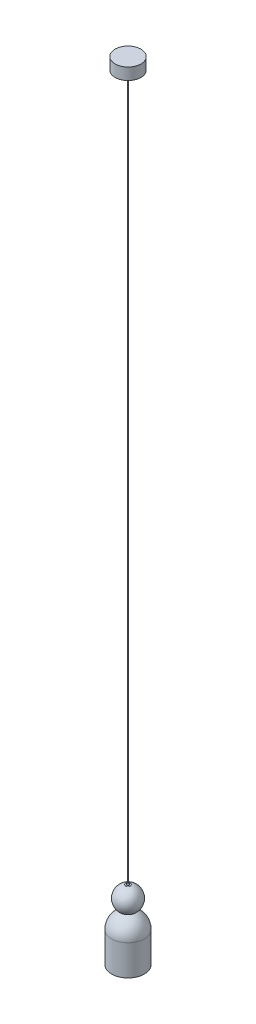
ISO-10303-21;
HEADER;
FILE_DESCRIPTION(('STEP AP214'),'2;1');
FILE_NAME('part.step','',(''),(''),'','','');
FILE_SCHEMA(('AUTOMOTIVE_DESIGN { 1 0 10303 214 1 1 1 1 }'));
ENDSEC;
DATA;
#1=APPLICATION_CONTEXT('core data for automotive mechanical design processes');
#2=APPLICATION_PROTOCOL_DEFINITION('international standard','automotive_design',2000,#1);
#3=PRODUCT_CONTEXT('',#1,'mechanical');
#4=PRODUCT('Part','Part','',(#3));
#5=PRODUCT_RELATED_PRODUCT_CATEGORY('part','',(#4));
#6=PRODUCT_DEFINITION_FORMATION('','',#4);
#7=PRODUCT_DEFINITION_CONTEXT('part definition',#1,'design');
#8=PRODUCT_DEFINITION('design','',#6,#7);
#9=PRODUCT_DEFINITION_SHAPE('','',#8);
#10=(LENGTH_UNIT() NAMED_UNIT(*) SI_UNIT(.MILLI.,.METRE.));
#11=(NAMED_UNIT(*) PLANE_ANGLE_UNIT() SI_UNIT($,.RADIAN.));
#12=(NAMED_UNIT(*) SI_UNIT($,.STERADIAN.) SOLID_ANGLE_UNIT());
#13=UNCERTAINTY_MEASURE_WITH_UNIT(LENGTH_MEASURE(1.E-05),#10,'distance_accuracy_value','');
#14=(GEOMETRIC_REPRESENTATION_CONTEXT(3) GLOBAL_UNCERTAINTY_ASSIGNED_CONTEXT((#13)) GLOBAL_UNIT_ASSIGNED_CONTEXT((#10,
#11,#12)) REPRESENTATION_CONTEXT('',''));
#15=CARTESIAN_POINT('',(0.,0.,0.));
#16=DIRECTION('',(0.,0.,1.));
#17=DIRECTION('',(1.,0.,0.));
#18=AXIS2_PLACEMENT_3D('',#15,#16,#17);
#19=CARTESIAN_POINT('',(0.,3305.,0.));
#20=DIRECTION('',(0.,-1.,0.));
#21=DIRECTION('',(0.,0.,-1.));
#22=AXIS2_PLACEMENT_3D('',#19,#20,#21);
#23=CYLINDRICAL_SURFACE('',#22,1.5);
#24=CARTESIAN_POINT('',(0.,3305.,0.));
#25=DIRECTION('',(0.,1.,0.));
#26=DIRECTION('',(0.,0.,1.));
#27=AXIS2_PLACEMENT_3D('',#24,#25,#26);
#28=CIRCLE('',#27,1.5);
#29=CARTESIAN_POINT('',(0.,3305.,1.5));
#30=VERTEX_POINT('',#29);
#31=EDGE_CURVE('E11',#30,#30,#28,.T.);
#32=ORIENTED_EDGE('',*,*,#31,.F.);
#33=EDGE_LOOP('',(#32));
#34=FACE_BOUND('',#33,.T.);
#35=CARTESIAN_POINT('',(0.,305.,0.));
#36=DIRECTION('',(0.,1.,0.));
#37=DIRECTION('',(0.,0.,1.));
#38=AXIS2_PLACEMENT_3D('',#35,#36,#37);
#39=CIRCLE('',#38,1.5);
#40=CARTESIAN_POINT('',(0.,305.,1.5));
#41=VERTEX_POINT('',#40);
#42=EDGE_CURVE('E53',#41,#41,#39,.T.);
#43=ORIENTED_EDGE('',*,*,#42,.T.);
#44=EDGE_LOOP('',(#43));
#45=FACE_BOUND('',#44,.T.);
#46=ADVANCED_FACE('F50',(#34,#45),#23,.T.);
#47=CARTESIAN_POINT('',(0.,305.,0.));
#48=DIRECTION('',(0.,1.,0.));
#49=DIRECTION('',(0.,0.,1.));
#50=AXIS2_PLACEMENT_3D('',#47,#48,#49);
#51=PLANE('',#50);
#52=ORIENTED_EDGE('',*,*,#42,.F.);
#53=EDGE_LOOP('',(#52));
#54=FACE_BOUND('',#53,.T.);
#55=ADVANCED_FACE('F73',(#54),#51,.F.);
#56=CARTESIAN_POINT('',(0.,3355.038,0.));
#57=DIRECTION('',(0.,-1.,0.));
#58=DIRECTION('',(0.,0.,-1.));
#59=AXIS2_PLACEMENT_3D('',#56,#57,#58);
#60=CYLINDRICAL_SURFACE('',#59,54.991);
#61=CARTESIAN_POINT('',(0.,3355.038,0.));
#62=DIRECTION('',(0.,1.,0.));
#63=DIRECTION('',(0.,0.,1.));
#64=AXIS2_PLACEMENT_3D('',#61,#62,#63);
#65=CIRCLE('',#64,54.991);
#66=CARTESIAN_POINT('',(0.,3355.038,54.991));
#67=VERTEX_POINT('',#66);
#68=EDGE_CURVE('E60',#67,#67,#65,.T.);
#69=ORIENTED_EDGE('',*,*,#68,.F.);
#70=EDGE_LOOP('',(#69));
#71=FACE_BOUND('',#70,.T.);
#72=CARTESIAN_POINT('',(0.,3305.,0.));
#73=DIRECTION('',(0.,1.,0.));
#74=DIRECTION('',(0.,0.,1.));
#75=AXIS2_PLACEMENT_3D('',#72,#73,#74);
#76=CIRCLE('',#75,54.991);
#77=CARTESIAN_POINT('',(0.,3305.,54.991));
#78=VERTEX_POINT('',#77);
#79=EDGE_CURVE('E62',#78,#78,#76,.T.);
#80=ORIENTED_EDGE('',*,*,#79,.T.);
#81=EDGE_LOOP('',(#80));
#82=FACE_BOUND('',#81,.T.);
#83=ADVANCED_FACE('F70',(#71,#82),#60,.T.);
#84=CARTESIAN_POINT('',(0.,3355.038,0.));
#85=DIRECTION('',(0.,1.,0.));
#86=DIRECTION('',(0.,0.,1.));
#87=AXIS2_PLACEMENT_3D('',#84,#85,#86);
#88=PLANE('',#87);
#89=ORIENTED_EDGE('',*,*,#68,.T.);
#90=EDGE_LOOP('',(#89));
#91=FACE_BOUND('',#90,.T.);
#92=ADVANCED_FACE('F68',(#91),#88,.T.);
#93=CARTESIAN_POINT('',(0.,3305.,0.));
#94=DIRECTION('',(0.,1.,0.));
#95=DIRECTION('',(0.,0.,1.));
#96=AXIS2_PLACEMENT_3D('',#93,#94,#95);
#97=PLANE('',#96);
#98=ORIENTED_EDGE('',*,*,#31,.T.);
#99=EDGE_LOOP('',(#98));
#100=FACE_BOUND('',#99,.T.);
#101=ORIENTED_EDGE('',*,*,#79,.F.);
#102=EDGE_LOOP('',(#101));
#103=FACE_BOUND('',#102,.T.);
#104=ADVANCED_FACE('F77',(#100,#103),#97,.F.);
#105=CLOSED_SHELL('',(#46,#55,#83,#92,#104));
#106=MANIFOLD_SOLID_BREP('B2',#105);
#107=CARTESIAN_POINT('',(0.,296.,0.));
#108=DIRECTION('',(0.,-1.,0.));
#109=DIRECTION('',(0.,0.,-1.));
#110=AXIS2_PLACEMENT_3D('',#107,#108,#109);
#111=CYLINDRICAL_SURFACE('',#110,10.);
#112=CARTESIAN_POINT('',(0.,296.,0.));
#113=DIRECTION('',(0.,1.,0.));
#114=DIRECTION('',(0.,0.,1.));
#115=AXIS2_PLACEMENT_3D('',#112,#113,#114);
#116=CIRCLE('',#115,10.);
#117=CARTESIAN_POINT('',(0.,296.,10.));
#118=VERTEX_POINT('',#117);
#119=EDGE_CURVE('E49',#118,#118,#116,.T.);
#120=ORIENTED_EDGE('',*,*,#119,.F.);
#121=EDGE_LOOP('',(#120));
#122=FACE_BOUND('',#121,.T.);
#123=CARTESIAN_POINT('',(0.,295.,0.));
#124=DIRECTION('',(0.,1.,0.));
#125=DIRECTION('',(0.,0.,1.));
#126=AXIS2_PLACEMENT_3D('',#123,#124,#125);
#127=CIRCLE('',#126,10.);
#128=CARTESIAN_POINT('',(0.,295.,10.));
#129=VERTEX_POINT('',#128);
#130=EDGE_CURVE('E141',#129,#129,#127,.T.);
#131=ORIENTED_EDGE('',*,*,#130,.T.);
#132=EDGE_LOOP('',(#131));
#133=FACE_BOUND('',#132,.T.);
#134=ADVANCED_FACE('F138',(#122,#133),#111,.T.);
#135=CARTESIAN_POINT('',(0.,296.,0.));
#136=DIRECTION('',(0.,1.,0.));
#137=DIRECTION('',(0.,0.,1.));
#138=AXIS2_PLACEMENT_3D('',#135,#136,#137);
#139=PLANE('',#138);
#140=ORIENTED_EDGE('',*,*,#119,.T.);
#141=EDGE_LOOP('',(#140));
#142=FACE_BOUND('',#141,.T.);
#143=ADVANCED_FACE('F153',(#142),#139,.T.);
#144=CARTESIAN_POINT('',(0.,295.,0.));
#145=DIRECTION('',(0.,1.,0.));
#146=DIRECTION('',(0.,0.,1.));
#147=AXIS2_PLACEMENT_3D('',#144,#145,#146);
#148=PLANE('',#147);
#149=ORIENTED_EDGE('',*,*,#130,.F.);
#150=EDGE_LOOP('',(#149));
#151=FACE_BOUND('',#150,.T.);
#152=ADVANCED_FACE('F151',(#151),#148,.F.);
#153=CLOSED_SHELL('',(#134,#143,#152));
#154=MANIFOLD_SOLID_BREP('B6',#153);
#155=CARTESIAN_POINT('',(0.,305.,0.));
#156=DIRECTION('',(0.,-1.,0.));
#157=DIRECTION('',(0.,0.,-1.));
#158=AXIS2_PLACEMENT_3D('',#155,#156,#157);
#159=CYLINDRICAL_SURFACE('',#158,5.);
#160=CARTESIAN_POINT('',(0.,305.,0.));
#161=DIRECTION('',(0.,1.,0.));
#162=DIRECTION('',(0.,0.,1.));
#163=AXIS2_PLACEMENT_3D('',#160,#161,#162);
#164=CIRCLE('',#163,5.);
#165=CARTESIAN_POINT('',(0.,305.,5.));
#166=VERTEX_POINT('',#165);
#167=EDGE_CURVE('E137',#166,#166,#164,.T.);
#168=ORIENTED_EDGE('',*,*,#167,.F.);
#169=EDGE_LOOP('',(#168));
#170=FACE_BOUND('',#169,.T.);
#171=CARTESIAN_POINT('',(0.,295.,0.));
#172=DIRECTION('',(0.,1.,0.));
#173=DIRECTION('',(0.,0.,1.));
#174=AXIS2_PLACEMENT_3D('',#171,#172,#173);
#175=CIRCLE('',#174,5.);
#176=CARTESIAN_POINT('',(0.,295.,5.));
#177=VERTEX_POINT('',#176);
#178=EDGE_CURVE('E193',#177,#177,#175,.T.);
#179=ORIENTED_EDGE('',*,*,#178,.T.);
#180=EDGE_LOOP('',(#179));
#181=FACE_BOUND('',#180,.T.);
#182=ADVANCED_FACE('F190',(#170,#181),#159,.T.);
#183=CARTESIAN_POINT('',(0.,305.,0.));
#184=DIRECTION('',(0.,1.,0.));
#185=DIRECTION('',(0.,0.,1.));
#186=AXIS2_PLACEMENT_3D('',#183,#184,#185);
#187=PLANE('',#186);
#188=ORIENTED_EDGE('',*,*,#167,.T.);
#189=EDGE_LOOP('',(#188));
#190=FACE_BOUND('',#189,.T.);
#191=ADVANCED_FACE('F205',(#190),#187,.T.);
#192=CARTESIAN_POINT('',(0.,295.,0.));
#193=DIRECTION('',(0.,1.,0.));
#194=DIRECTION('',(0.,0.,1.));
#195=AXIS2_PLACEMENT_3D('',#192,#193,#194);
#196=PLANE('',#195);
#197=ORIENTED_EDGE('',*,*,#178,.F.);
#198=EDGE_LOOP('',(#197));
#199=FACE_BOUND('',#198,.T.);
#200=ADVANCED_FACE('F203',(#199),#196,.F.);
#201=CLOSED_SHELL('',(#182,#191,#200));
#202=MANIFOLD_SOLID_BREP('B44',#201);
#203=CARTESIAN_POINT('',(0.,245.25574438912,0.));
#204=DIRECTION('',(0.,-1.,0.));
#205=DIRECTION('',(0.,0.,1.));
#206=AXIS2_PLACEMENT_3D('',#203,#204,#205);
#207=SPHERICAL_SURFACE('',#206,50.);
#208=CARTESIAN_POINT('',(0.,195.25574438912,0.));
#209=VERTEX_POINT('',#208);
#210=VERTEX_LOOP('',#209);
#211=FACE_BOUND('',#210,.T.);
#212=ADVANCED_FACE('F243',(#211),#207,.T.);
#213=CLOSED_SHELL('',(#212));
#214=MANIFOLD_SOLID_BREP('B132',#213);
#215=CARTESIAN_POINT('',(0.,130.,0.));
#216=DIRECTION('',(0.,-1.,0.));
#217=DIRECTION('',(1.,0.,0.));
#218=AXIS2_PLACEMENT_3D('',#215,#216,#217);
#219=SPHERICAL_SURFACE('',#218,70.);
#220=CARTESIAN_POINT('',(0.,130.,0.));
#221=DIRECTION('',(0.,-1.,0.));
#222=DIRECTION('',(1.,0.,0.));
#223=AXIS2_PLACEMENT_3D('',#220,#221,#222);
#224=CIRCLE('',#223,70.);
#225=CARTESIAN_POINT('',(70.,130.,0.));
#226=VERTEX_POINT('',#225);
#227=EDGE_CURVE('E242',#226,#226,#224,.T.);
#228=ORIENTED_EDGE('',*,*,#227,.F.);
#229=EDGE_LOOP('',(#228));
#230=FACE_BOUND('',#229,.T.);
#231=ADVANCED_FACE('F257',(#230),#219,.T.);
#232=CARTESIAN_POINT('',(0.,0.,0.));
#233=DIRECTION('',(0.,-1.,0.));
#234=DIRECTION('',(1.,0.,0.));
#235=AXIS2_PLACEMENT_3D('',#232,#233,#234);
#236=CYLINDRICAL_SURFACE('',#235,70.);
#237=ORIENTED_EDGE('',*,*,#227,.T.);
#238=EDGE_LOOP('',(#237));
#239=FACE_BOUND('',#238,.T.);
#240=CARTESIAN_POINT('',(0.,0.,0.));
#241=DIRECTION('',(0.,-1.,0.));
#242=DIRECTION('',(1.,0.,0.));
#243=AXIS2_PLACEMENT_3D('',#240,#241,#242);
#244=CIRCLE('',#243,70.);
#245=CARTESIAN_POINT('',(70.,0.,0.));
#246=VERTEX_POINT('',#245);
#247=EDGE_CURVE('E263',#246,#246,#244,.T.);
#248=ORIENTED_EDGE('',*,*,#247,.F.);
#249=EDGE_LOOP('',(#248));
#250=FACE_BOUND('',#249,.T.);
#251=ADVANCED_FACE('F282',(#239,#250),#236,.T.);
#252=CARTESIAN_POINT('',(0.,0.,0.));
#253=DIRECTION('',(0.,-1.,0.));
#254=DIRECTION('',(1.,0.,0.));
#255=AXIS2_PLACEMENT_3D('',#252,#253,#254);
#256=PLANE('',#255);
#257=CARTESIAN_POINT('',(0.,0.,0.));
#258=DIRECTION('',(0.,-1.,0.));
#259=DIRECTION('',(1.,0.,0.));
#260=AXIS2_PLACEMENT_3D('',#257,#258,#259);
#261=CIRCLE('',#260,67.);
#262=CARTESIAN_POINT('',(67.,0.,0.));
#263=VERTEX_POINT('',#262);
#264=EDGE_CURVE('E271',#263,#263,#261,.T.);
#265=ORIENTED_EDGE('',*,*,#264,.F.);
#266=EDGE_LOOP('',(#265));
#267=FACE_BOUND('',#266,.T.);
#268=ORIENTED_EDGE('',*,*,#247,.T.);
#269=EDGE_LOOP('',(#268));
#270=FACE_BOUND('',#269,.T.);
#271=ADVANCED_FACE('F279',(#267,#270),#256,.T.);
#272=CARTESIAN_POINT('',(0.,130.,0.));
#273=DIRECTION('',(0.,-1.,0.));
#274=DIRECTION('',(1.,0.,0.));
#275=AXIS2_PLACEMENT_3D('',#272,#273,#274);
#276=SPHERICAL_SURFACE('',#275,67.);
#277=CARTESIAN_POINT('',(0.,130.,0.));
#278=DIRECTION('',(0.,-1.,0.));
#279=DIRECTION('',(1.,0.,0.));
#280=AXIS2_PLACEMENT_3D('',#277,#278,#279);
#281=CIRCLE('',#280,67.);
#282=CARTESIAN_POINT('',(67.,130.,0.));
#283=VERTEX_POINT('',#282);
#284=EDGE_CURVE('E267',#283,#283,#281,.T.);
#285=ORIENTED_EDGE('',*,*,#284,.T.);
#286=EDGE_LOOP('',(#285));
#287=FACE_BOUND('',#286,.T.);
#288=ADVANCED_FACE('F281',(#287),#276,.F.);
#289=CARTESIAN_POINT('',(0.,0.,0.));
#290=DIRECTION('',(0.,-1.,0.));
#291=DIRECTION('',(1.,0.,0.));
#292=AXIS2_PLACEMENT_3D('',#289,#290,#291);
#293=CYLINDRICAL_SURFACE('',#292,67.);
#294=ORIENTED_EDGE('',*,*,#284,.F.);
#295=EDGE_LOOP('',(#294));
#296=FACE_BOUND('',#295,.T.);
#297=ORIENTED_EDGE('',*,*,#264,.T.);
#298=EDGE_LOOP('',(#297));
#299=FACE_BOUND('',#298,.T.);
#300=ADVANCED_FACE('F277',(#296,#299),#293,.F.);
#301=CLOSED_SHELL('',(#231,#251,#271,#288,#300));
#302=MANIFOLD_SOLID_BREP('B186',#301);
#303=ADVANCED_BREP_SHAPE_REPRESENTATION('',(#18,#106,#154,#202,#214,#302),#14);
#304=SHAPE_DEFINITION_REPRESENTATION(#9,#303);
ENDSEC;
END-ISO-10303-21;
